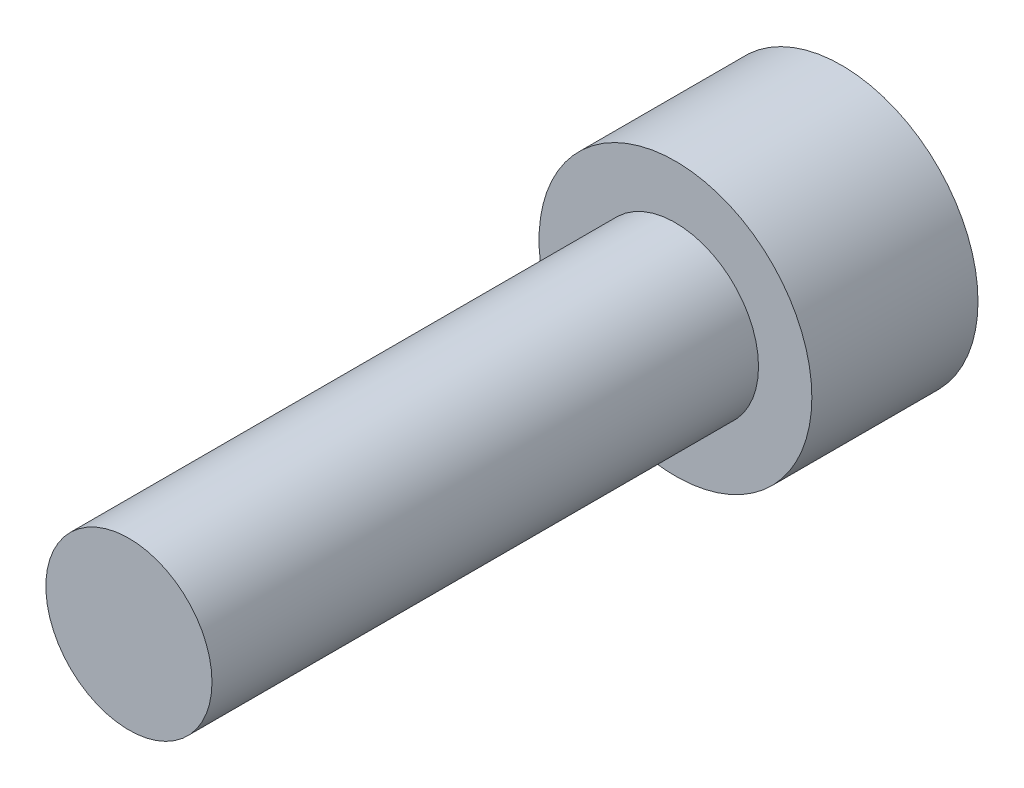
ISO-10303-21;
HEADER;
FILE_DESCRIPTION(('STEP AP214'),'2;1');
FILE_NAME('part.step','',(''),(''),'','','');
FILE_SCHEMA(('AUTOMOTIVE_DESIGN { 1 0 10303 214 1 1 1 1 }'));
ENDSEC;
DATA;
#1=APPLICATION_CONTEXT('core data for automotive mechanical design processes');
#2=APPLICATION_PROTOCOL_DEFINITION('international standard','automotive_design',2000,#1);
#3=PRODUCT_CONTEXT('',#1,'mechanical');
#4=PRODUCT('Part','Part','',(#3));
#5=PRODUCT_RELATED_PRODUCT_CATEGORY('part','',(#4));
#6=PRODUCT_DEFINITION_FORMATION('','',#4);
#7=PRODUCT_DEFINITION_CONTEXT('part definition',#1,'design');
#8=PRODUCT_DEFINITION('design','',#6,#7);
#9=PRODUCT_DEFINITION_SHAPE('','',#8);
#10=(LENGTH_UNIT() NAMED_UNIT(*) SI_UNIT(.MILLI.,.METRE.));
#11=(NAMED_UNIT(*) PLANE_ANGLE_UNIT() SI_UNIT($,.RADIAN.));
#12=(NAMED_UNIT(*) SI_UNIT($,.STERADIAN.) SOLID_ANGLE_UNIT());
#13=UNCERTAINTY_MEASURE_WITH_UNIT(LENGTH_MEASURE(1.E-05),#10,'distance_accuracy_value','');
#14=(GEOMETRIC_REPRESENTATION_CONTEXT(3) GLOBAL_UNCERTAINTY_ASSIGNED_CONTEXT((#13)) GLOBAL_UNIT_ASSIGNED_CONTEXT((#10,
#11,#12)) REPRESENTATION_CONTEXT('',''));
#15=CARTESIAN_POINT('',(0.,0.,0.));
#16=DIRECTION('',(0.,0.,1.));
#17=DIRECTION('',(1.,0.,0.));
#18=AXIS2_PLACEMENT_3D('',#15,#16,#17);
#19=CARTESIAN_POINT('',(0.,0.,15.875));
#20=DIRECTION('',(0.,0.,1.));
#21=DIRECTION('',(1.,0.,0.));
#22=AXIS2_PLACEMENT_3D('',#19,#20,#21);
#23=PLANE('',#22);
#24=CARTESIAN_POINT('',(0.,0.,15.875));
#25=DIRECTION('',(0.,0.,1.));
#26=DIRECTION('',(1.,0.,0.));
#27=AXIS2_PLACEMENT_3D('',#24,#25,#26);
#28=CIRCLE('',#27,2.413);
#29=CARTESIAN_POINT('',(2.413,0.,15.875));
#30=VERTEX_POINT('',#29);
#31=EDGE_CURVE('E11',#30,#30,#28,.T.);
#32=ORIENTED_EDGE('',*,*,#31,.T.);
#33=EDGE_LOOP('',(#32));
#34=FACE_BOUND('',#33,.T.);
#35=ADVANCED_FACE('F32',(#34),#23,.T.);
#36=CARTESIAN_POINT('',(0.,0.,15.875));
#37=DIRECTION('',(0.,0.,1.));
#38=DIRECTION('',(1.,0.,0.));
#39=AXIS2_PLACEMENT_3D('',#36,#37,#38);
#40=CYLINDRICAL_SURFACE('',#39,2.413);
#41=CARTESIAN_POINT('',(0.,0.,0.));
#42=DIRECTION('',(0.,0.,1.));
#43=DIRECTION('',(1.,0.,0.));
#44=AXIS2_PLACEMENT_3D('',#41,#42,#43);
#45=CIRCLE('',#44,2.413);
#46=CARTESIAN_POINT('',(2.413,0.,0.));
#47=VERTEX_POINT('',#46);
#48=EDGE_CURVE('E39',#47,#47,#45,.T.);
#49=ORIENTED_EDGE('',*,*,#48,.T.);
#50=EDGE_LOOP('',(#49));
#51=FACE_BOUND('',#50,.T.);
#52=ORIENTED_EDGE('',*,*,#31,.F.);
#53=EDGE_LOOP('',(#52));
#54=FACE_BOUND('',#53,.T.);
#55=ADVANCED_FACE('F146',(#51,#54),#40,.T.);
#56=CARTESIAN_POINT('',(0.,-2.413,0.));
#57=DIRECTION('',(0.,0.,1.));
#58=DIRECTION('',(1.,0.,0.));
#59=AXIS2_PLACEMENT_3D('',#56,#57,#58);
#60=PLANE('',#59);
#61=CARTESIAN_POINT('',(0.,0.,0.));
#62=DIRECTION('',(0.,0.,1.));
#63=DIRECTION('',(1.,0.,0.));
#64=AXIS2_PLACEMENT_3D('',#61,#62,#63);
#65=CIRCLE('',#64,3.9624);
#66=CARTESIAN_POINT('',(3.9624,0.,0.));
#67=VERTEX_POINT('',#66);
#68=EDGE_CURVE('E141',#67,#67,#65,.T.);
#69=ORIENTED_EDGE('',*,*,#68,.T.);
#70=EDGE_LOOP('',(#69));
#71=FACE_BOUND('',#70,.T.);
#72=ORIENTED_EDGE('',*,*,#48,.F.);
#73=EDGE_LOOP('',(#72));
#74=FACE_BOUND('',#73,.T.);
#75=ADVANCED_FACE('F149',(#71,#74),#60,.T.);
#76=CARTESIAN_POINT('',(0.,0.,15.875));
#77=DIRECTION('',(0.,0.,1.));
#78=DIRECTION('',(1.,0.,0.));
#79=AXIS2_PLACEMENT_3D('',#76,#77,#78);
#80=CYLINDRICAL_SURFACE('',#79,3.9624);
#81=CARTESIAN_POINT('',(0.,0.,-4.826));
#82=DIRECTION('',(0.,0.,1.));
#83=DIRECTION('',(1.,0.,0.));
#84=AXIS2_PLACEMENT_3D('',#81,#82,#83);
#85=CIRCLE('',#84,3.9624);
#86=CARTESIAN_POINT('',(3.9624,0.,-4.826));
#87=VERTEX_POINT('',#86);
#88=EDGE_CURVE('E133',#87,#87,#85,.T.);
#89=ORIENTED_EDGE('',*,*,#88,.T.);
#90=EDGE_LOOP('',(#89));
#91=FACE_BOUND('',#90,.T.);
#92=ORIENTED_EDGE('',*,*,#68,.F.);
#93=EDGE_LOOP('',(#92));
#94=FACE_BOUND('',#93,.T.);
#95=ADVANCED_FACE('F151',(#91,#94),#80,.T.);
#96=CARTESIAN_POINT('',(0.,-3.9624,-4.826));
#97=DIRECTION('',(0.,0.,-1.));
#98=DIRECTION('',(-1.,0.,0.));
#99=AXIS2_PLACEMENT_3D('',#96,#97,#98);
#100=PLANE('',#99);
#101=DIRECTION('',(0.866025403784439,-0.5,0.));
#102=VECTOR('',#101,1.);
#103=CARTESIAN_POINT('',(0.,2.28769270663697,-4.826));
#104=LINE('',#103,#102);
#105=CARTESIAN_POINT('',(0.,2.28769270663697,-4.826));
#106=VERTEX_POINT('',#105);
#107=CARTESIAN_POINT('',(1.9812,1.14384635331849,-4.826));
#108=VERTEX_POINT('',#107);
#109=EDGE_CURVE('E46',#106,#108,#104,.T.);
#110=ORIENTED_EDGE('',*,*,#109,.F.);
#111=DIRECTION('',(0.866025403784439,0.5,0.));
#112=VECTOR('',#111,1.);
#113=CARTESIAN_POINT('',(-1.9812,1.14384635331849,-4.826));
#114=LINE('',#113,#112);
#115=CARTESIAN_POINT('',(-1.9812,1.14384635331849,-4.826));
#116=VERTEX_POINT('',#115);
#117=EDGE_CURVE('E129',#116,#106,#114,.T.);
#118=ORIENTED_EDGE('',*,*,#117,.F.);
#119=DIRECTION('',(0.,1.,0.));
#120=VECTOR('',#119,1.);
#121=CARTESIAN_POINT('',(-1.9812,-1.14384635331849,-4.826));
#122=LINE('',#121,#120);
#123=CARTESIAN_POINT('',(-1.9812,-1.14384635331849,-4.826));
#124=VERTEX_POINT('',#123);
#125=EDGE_CURVE('E127',#124,#116,#122,.T.);
#126=ORIENTED_EDGE('',*,*,#125,.F.);
#127=DIRECTION('',(-0.866025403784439,0.5,0.));
#128=VECTOR('',#127,1.);
#129=CARTESIAN_POINT('',(0.,-2.28769270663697,-4.826));
#130=LINE('',#129,#128);
#131=CARTESIAN_POINT('',(0.,-2.28769270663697,-4.826));
#132=VERTEX_POINT('',#131);
#133=EDGE_CURVE('E94',#132,#124,#130,.T.);
#134=ORIENTED_EDGE('',*,*,#133,.F.);
#135=DIRECTION('',(-0.866025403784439,-0.5,0.));
#136=VECTOR('',#135,1.);
#137=CARTESIAN_POINT('',(1.9812,-1.14384635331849,-4.826));
#138=LINE('',#137,#136);
#139=CARTESIAN_POINT('',(1.9812,-1.14384635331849,-4.826));
#140=VERTEX_POINT('',#139);
#141=EDGE_CURVE('E123',#140,#132,#138,.T.);
#142=ORIENTED_EDGE('',*,*,#141,.F.);
#143=DIRECTION('',(0.,-1.,0.));
#144=VECTOR('',#143,1.);
#145=CARTESIAN_POINT('',(1.9812,1.14384635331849,-4.826));
#146=LINE('',#145,#144);
#147=EDGE_CURVE('E120',#108,#140,#146,.T.);
#148=ORIENTED_EDGE('',*,*,#147,.F.);
#149=EDGE_LOOP('',(#110,#118,#126,#134,#142,#148));
#150=FACE_BOUND('',#149,.T.);
#151=ORIENTED_EDGE('',*,*,#88,.F.);
#152=EDGE_LOOP('',(#151));
#153=FACE_BOUND('',#152,.T.);
#154=ADVANCED_FACE('F158',(#150,#153),#100,.T.);
#155=CARTESIAN_POINT('',(0.,2.28769270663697,-1.778));
#156=DIRECTION('',(0.5,0.866025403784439,0.));
#157=DIRECTION('',(-0.866025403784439,0.5,0.));
#158=AXIS2_PLACEMENT_3D('',#155,#156,#157);
#159=PLANE('',#158);
#160=ORIENTED_EDGE('',*,*,#109,.T.);
#161=DIRECTION('',(0.,0.,-1.));
#162=VECTOR('',#161,1.);
#163=CARTESIAN_POINT('',(1.9812,1.14384635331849,-1.778));
#164=LINE('',#163,#162);
#165=CARTESIAN_POINT('',(1.9812,1.14384635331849,-1.778));
#166=VERTEX_POINT('',#165);
#167=EDGE_CURVE('E76',#166,#108,#164,.T.);
#168=ORIENTED_EDGE('',*,*,#167,.F.);
#169=DIRECTION('',(0.866025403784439,-0.5,0.));
#170=VECTOR('',#169,1.);
#171=CARTESIAN_POINT('',(0.,2.28769270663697,-1.778));
#172=LINE('',#171,#170);
#173=CARTESIAN_POINT('',(0.,2.28769270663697,-1.778));
#174=VERTEX_POINT('',#173);
#175=EDGE_CURVE('E131',#174,#166,#172,.T.);
#176=ORIENTED_EDGE('',*,*,#175,.F.);
#177=DIRECTION('',(0.,0.,-1.));
#178=VECTOR('',#177,1.);
#179=CARTESIAN_POINT('',(0.,2.28769270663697,-1.778));
#180=LINE('',#179,#178);
#181=EDGE_CURVE('E54',#174,#106,#180,.T.);
#182=ORIENTED_EDGE('',*,*,#181,.T.);
#183=EDGE_LOOP('',(#160,#168,#176,#182));
#184=FACE_BOUND('',#183,.T.);
#185=ADVANCED_FACE('F189',(#184),#159,.F.);
#186=CARTESIAN_POINT('',(-1.9812,1.14384635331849,-1.778));
#187=DIRECTION('',(-0.5,0.866025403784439,0.));
#188=DIRECTION('',(-0.866025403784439,-0.5,0.));
#189=AXIS2_PLACEMENT_3D('',#186,#187,#188);
#190=PLANE('',#189);
#191=ORIENTED_EDGE('',*,*,#117,.T.);
#192=ORIENTED_EDGE('',*,*,#181,.F.);
#193=DIRECTION('',(0.866025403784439,0.5,0.));
#194=VECTOR('',#193,1.);
#195=CARTESIAN_POINT('',(-1.9812,1.14384635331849,-1.778));
#196=LINE('',#195,#194);
#197=CARTESIAN_POINT('',(-1.9812,1.14384635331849,-1.778));
#198=VERTEX_POINT('',#197);
#199=EDGE_CURVE('E106',#198,#174,#196,.T.);
#200=ORIENTED_EDGE('',*,*,#199,.F.);
#201=DIRECTION('',(0.,0.,-1.));
#202=VECTOR('',#201,1.);
#203=CARTESIAN_POINT('',(-1.9812,1.14384635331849,-1.778));
#204=LINE('',#203,#202);
#205=EDGE_CURVE('E98',#198,#116,#204,.T.);
#206=ORIENTED_EDGE('',*,*,#205,.T.);
#207=EDGE_LOOP('',(#191,#192,#200,#206));
#208=FACE_BOUND('',#207,.T.);
#209=ADVANCED_FACE('F199',(#208),#190,.F.);
#210=CARTESIAN_POINT('',(-1.9812,-1.14384635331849,-1.778));
#211=DIRECTION('',(-1.,0.,0.));
#212=DIRECTION('',(0.,-1.,0.));
#213=AXIS2_PLACEMENT_3D('',#210,#211,#212);
#214=PLANE('',#213);
#215=ORIENTED_EDGE('',*,*,#125,.T.);
#216=ORIENTED_EDGE('',*,*,#205,.F.);
#217=DIRECTION('',(0.,1.,0.));
#218=VECTOR('',#217,1.);
#219=CARTESIAN_POINT('',(-1.9812,-1.14384635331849,-1.778));
#220=LINE('',#219,#218);
#221=CARTESIAN_POINT('',(-1.9812,-1.14384635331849,-1.778));
#222=VERTEX_POINT('',#221);
#223=EDGE_CURVE('E102',#222,#198,#220,.T.);
#224=ORIENTED_EDGE('',*,*,#223,.F.);
#225=DIRECTION('',(0.,0.,-1.));
#226=VECTOR('',#225,1.);
#227=CARTESIAN_POINT('',(-1.9812,-1.14384635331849,-1.778));
#228=LINE('',#227,#226);
#229=EDGE_CURVE('E87',#222,#124,#228,.T.);
#230=ORIENTED_EDGE('',*,*,#229,.T.);
#231=EDGE_LOOP('',(#215,#216,#224,#230));
#232=FACE_BOUND('',#231,.T.);
#233=ADVANCED_FACE('F103',(#232),#214,.F.);
#234=CARTESIAN_POINT('',(0.,-2.28769270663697,-1.778));
#235=DIRECTION('',(-0.5,-0.866025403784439,0.));
#236=DIRECTION('',(0.866025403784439,-0.5,0.));
#237=AXIS2_PLACEMENT_3D('',#234,#235,#236);
#238=PLANE('',#237);
#239=ORIENTED_EDGE('',*,*,#133,.T.);
#240=ORIENTED_EDGE('',*,*,#229,.F.);
#241=DIRECTION('',(-0.866025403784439,0.5,0.));
#242=VECTOR('',#241,1.);
#243=CARTESIAN_POINT('',(0.,-2.28769270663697,-1.778));
#244=LINE('',#243,#242);
#245=CARTESIAN_POINT('',(0.,-2.28769270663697,-1.778));
#246=VERTEX_POINT('',#245);
#247=EDGE_CURVE('E91',#246,#222,#244,.T.);
#248=ORIENTED_EDGE('',*,*,#247,.F.);
#249=DIRECTION('',(0.,0.,-1.));
#250=VECTOR('',#249,1.);
#251=CARTESIAN_POINT('',(0.,-2.28769270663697,-1.778));
#252=LINE('',#251,#250);
#253=EDGE_CURVE('E99',#246,#132,#252,.T.);
#254=ORIENTED_EDGE('',*,*,#253,.T.);
#255=EDGE_LOOP('',(#239,#240,#248,#254));
#256=FACE_BOUND('',#255,.T.);
#257=ADVANCED_FACE('F89',(#256),#238,.F.);
#258=CARTESIAN_POINT('',(1.9812,-1.14384635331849,-1.778));
#259=DIRECTION('',(0.5,-0.866025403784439,0.));
#260=DIRECTION('',(0.866025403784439,0.5,0.));
#261=AXIS2_PLACEMENT_3D('',#258,#259,#260);
#262=PLANE('',#261);
#263=ORIENTED_EDGE('',*,*,#141,.T.);
#264=ORIENTED_EDGE('',*,*,#253,.F.);
#265=DIRECTION('',(-0.866025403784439,-0.5,0.));
#266=VECTOR('',#265,1.);
#267=CARTESIAN_POINT('',(1.9812,-1.14384635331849,-1.778));
#268=LINE('',#267,#266);
#269=CARTESIAN_POINT('',(1.9812,-1.14384635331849,-1.778));
#270=VERTEX_POINT('',#269);
#271=EDGE_CURVE('E112',#270,#246,#268,.T.);
#272=ORIENTED_EDGE('',*,*,#271,.F.);
#273=DIRECTION('',(0.,0.,-1.));
#274=VECTOR('',#273,1.);
#275=CARTESIAN_POINT('',(1.9812,-1.14384635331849,-1.778));
#276=LINE('',#275,#274);
#277=EDGE_CURVE('E136',#270,#140,#276,.T.);
#278=ORIENTED_EDGE('',*,*,#277,.T.);
#279=EDGE_LOOP('',(#263,#264,#272,#278));
#280=FACE_BOUND('',#279,.T.);
#281=ADVANCED_FACE('F224',(#280),#262,.F.);
#282=CARTESIAN_POINT('',(1.9812,1.14384635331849,-1.778));
#283=DIRECTION('',(1.,0.,0.));
#284=DIRECTION('',(0.,0.,-1.));
#285=AXIS2_PLACEMENT_3D('',#282,#283,#284);
#286=PLANE('',#285);
#287=ORIENTED_EDGE('',*,*,#147,.T.);
#288=ORIENTED_EDGE('',*,*,#277,.F.);
#289=DIRECTION('',(0.,-1.,0.));
#290=VECTOR('',#289,1.);
#291=CARTESIAN_POINT('',(1.9812,1.14384635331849,-1.778));
#292=LINE('',#291,#290);
#293=EDGE_CURVE('E114',#166,#270,#292,.T.);
#294=ORIENTED_EDGE('',*,*,#293,.F.);
#295=ORIENTED_EDGE('',*,*,#167,.T.);
#296=EDGE_LOOP('',(#287,#288,#294,#295));
#297=FACE_BOUND('',#296,.T.);
#298=ADVANCED_FACE('F233',(#297),#286,.F.);
#299=CARTESIAN_POINT('',(3.9624,0.,-1.778));
#300=DIRECTION('',(0.,0.,-1.));
#301=DIRECTION('',(-1.,0.,0.));
#302=AXIS2_PLACEMENT_3D('',#299,#300,#301);
#303=PLANE('',#302);
#304=ORIENTED_EDGE('',*,*,#175,.T.);
#305=ORIENTED_EDGE('',*,*,#293,.T.);
#306=ORIENTED_EDGE('',*,*,#271,.T.);
#307=ORIENTED_EDGE('',*,*,#247,.T.);
#308=ORIENTED_EDGE('',*,*,#223,.T.);
#309=ORIENTED_EDGE('',*,*,#199,.T.);
#310=EDGE_LOOP('',(#304,#305,#306,#307,#308,#309));
#311=FACE_BOUND('',#310,.T.);
#312=ADVANCED_FACE('F109',(#311),#303,.T.);
#313=CLOSED_SHELL('',(#35,#55,#75,#95,#154,#185,#209,#233,#257,#281,#298,#312));
#314=MANIFOLD_SOLID_BREP('B2',#313);
#315=ADVANCED_BREP_SHAPE_REPRESENTATION('',(#18,#314),#14);
#316=SHAPE_DEFINITION_REPRESENTATION(#9,#315);
ENDSEC;
END-ISO-10303-21;
